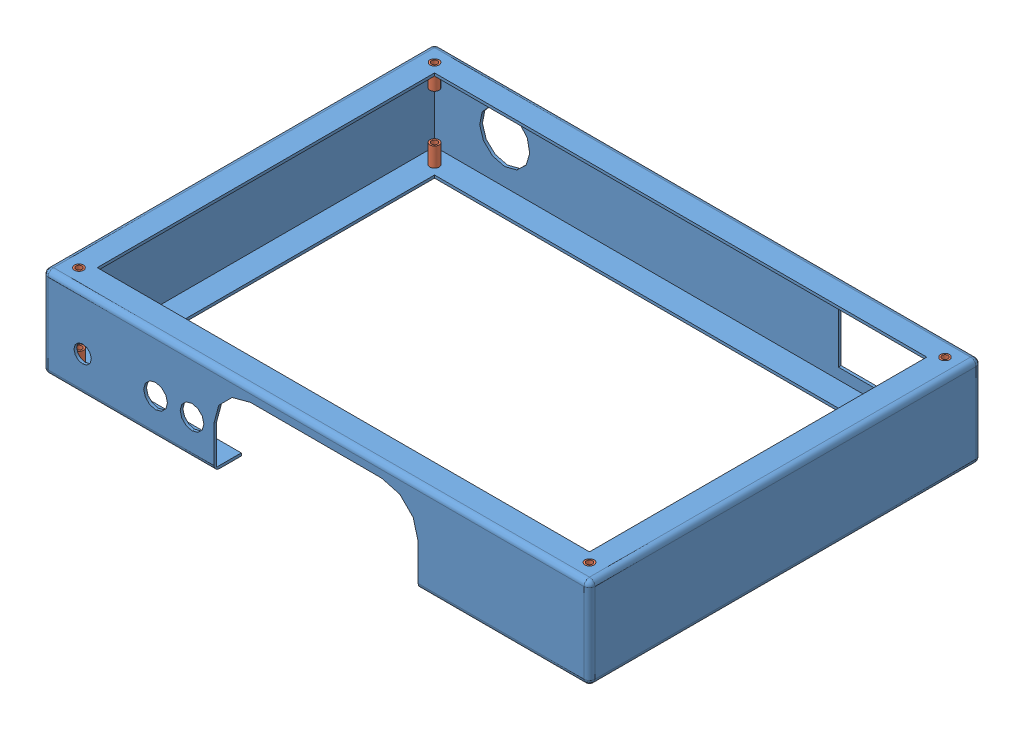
SolidWorks assembly Cpm_Pupitre_A.SLDASM, configuration Default (file format 13000). Lengths in mm.
Overall size (300 50 215).
9 component instances, 2 part files, 16 mates.
Components (placement in the parent):
- Cpm_PupCorps_A-1: Cpm_PupCorps_A.SLDPRT [Défaut] at (-7.6358 70.1686 228.0461) size (300 50 215)
- InsertM4-1: InsertM4.SLDPRT [Défaut] at (2.3642 108.1686 218.0461) x (0.999984 0 0.00565) z (0 1 0) size (5 5 12)
- InsertM4-2: InsertM4.SLDPRT [Défaut] at (2.3642 108.1686 23.0461) x (0.983131 0 -0.182903) z (0 1 0) size (5 5 12)
- InsertM4-4: InsertM4.SLDPRT [Défaut] at (282.3642 108.1686 23.0461) x (0.920586 0 -0.390539) z (0 1 0) size (5 5 12)
- InsertM4-6: InsertM4.SLDPRT [Défaut] at (282.3642 108.1686 218.0461) x (0.551666 0 -0.834065) z (0 1 0) size (5 5 12)
- InsertM4-8: InsertM4.SLDPRT [Défaut] at (282.3642 82.1686 23.0461) x (0.112871 0 0.99361) z (0 -1 0) size (5 5 12)
- InsertM4-10: InsertM4.SLDPRT [Défaut] at (282.3642 82.1686 218.0461) x (-0.113172 0 0.993575) z (0 -1 0) size (5 5 12)
- InsertM4-12: InsertM4.SLDPRT [Défaut] at (2.3642 82.1686 218.0461) x (-0.301911 0 0.953336) z (0 -1 0) size (5 5 12)
- InsertM4-14: InsertM4.SLDPRT [Défaut] at (2.3642 82.1686 23.0461) x (-0.437297 0 0.899317) z (0 -1 0) size (5 5 12)
Mates (geometry in assembly coordinates):
- Coaxiale1: concentric anti-aligned: cylinder of Cpm_PupCorps_A-1 through (2.3642 70.1686 218.0461) axis (0 1 0) radius 2.5; cylinder of InsertM4-1 through (2.3642 120.1686 218.0461) axis (0 -1 0) radius 2.5
- Coïncidente1: coincident aligned: plane of Cpm_PupCorps_A-1 through (-7.6358 120.1686 228.0461) normal (0 1 0); plane of InsertM4-1 through (2.3642 120.1686 218.0461) normal (0 1 0)
- Coaxiale2: concentric anti-aligned: cylinder of Cpm_PupCorps_A-1 through (2.3642 70.1686 23.0461) axis (0 1 0) radius 2.5; cylinder of InsertM4-2 through (2.3642 120.1686 23.0461) axis (0 -1 0) radius 2.5
- Coïncidente2: coincident aligned: plane of Cpm_PupCorps_A-1 through (-7.6358 120.1686 228.0461) normal (0 1 0); plane of InsertM4-2 through (2.3642 120.1686 23.0461) normal (0 1 0)
- Coaxiale3: concentric anti-aligned: cylinder of Cpm_PupCorps_A-1 through (282.3642 70.1686 23.0461) axis (0 1 0) radius 2.5; cylinder of InsertM4-4 through (282.3642 120.1686 23.0461) axis (0 -1 0) radius 2.5
- Coïncidente3: coincident aligned: plane of Cpm_PupCorps_A-1 through (-7.6358 120.1686 228.0461) normal (0 1 0); plane of InsertM4-4 through (282.3642 120.1686 23.0461) normal (0 1 0)
- Coaxiale4: concentric aligned: circle of Cpm_PupCorps_A-1; cylinder of InsertM4-6 through (282.3642 120.1686 218.0461) axis (0 -1 0) radius 2.5
- Coïncidente4: coincident aligned: plane of Cpm_PupCorps_A-1 through (-7.6358 120.1686 228.0461) normal (0 1 0); plane of InsertM4-6 through (282.3642 120.1686 218.0461) normal (0 1 0)
- Coaxiale5: concentric aligned: cylinder of Cpm_PupCorps_A-1 through (282.3642 70.1686 23.0461) axis (0 1 0) radius 2.5; cylinder of InsertM4-8 through (282.3642 70.1686 23.0461) axis (0 1 0) radius 2.5
- Coïncidente5: coincident aligned: plane of Cpm_PupCorps_A-1 through (-7.6358 70.1686 228.0461) normal (0 -1 0); plane of InsertM4-8 through (282.3642 70.1686 23.0461) normal (0 -1 0)
- Coaxiale6: concentric aligned: cylinder of Cpm_PupCorps_A-1 through (282.3642 70.1686 218.0461) axis (0 1 0) radius 2.5; cylinder of InsertM4-10 through (282.3642 70.1686 218.0461) axis (0 1 0) radius 2.5
- Coïncidente6: coincident aligned: plane of Cpm_PupCorps_A-1 through (-7.6358 70.1686 228.0461) normal (0 -1 0); plane of InsertM4-10 through (282.3642 70.1686 218.0461) normal (0 -1 0)
- Coaxiale7: concentric aligned: cylinder of Cpm_PupCorps_A-1 through (2.3642 70.1686 218.0461) axis (0 1 0) radius 2.5; cylinder of InsertM4-12 through (2.3642 70.1686 218.0461) axis (0 1 0) radius 2.5
- Coïncidente7: coincident aligned: plane of Cpm_PupCorps_A-1 through (-7.6358 70.1686 228.0461) normal (0 -1 0); plane of InsertM4-12 through (2.3642 70.1686 218.0461) normal (0 -1 0)
- Coaxiale8: concentric aligned: cylinder of Cpm_PupCorps_A-1 through (2.3642 70.1686 23.0461) axis (0 1 0) radius 2.5; cylinder of InsertM4-14 through (2.3642 70.1686 23.0461) axis (0 1 0) radius 2.5
- Coïncidente8: coincident aligned: plane of Cpm_PupCorps_A-1 through (-7.6358 70.1686 228.0461) normal (0 -1 0); plane of InsertM4-14 through (2.3642 70.1686 23.0461) normal (0 -1 0)
